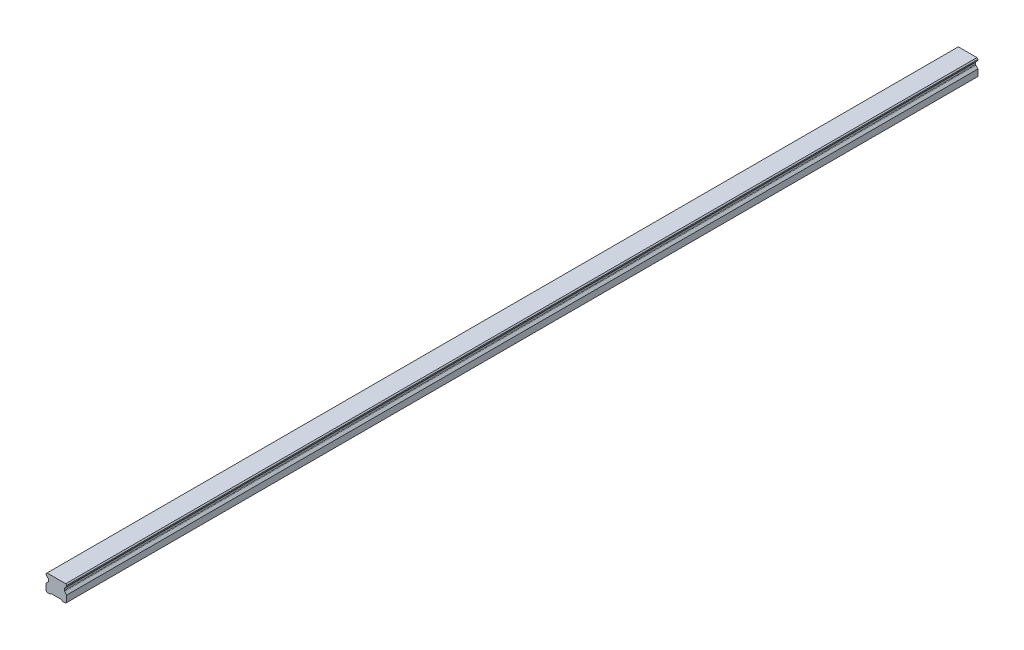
from build123d import *

# Parameters (mm, degrees)
SKETCH1_W           = 20
SKETCH1_H           = 16.3
BOSS_EXTRUDE1_DEPTH = 440
CUT_EXTRUDE1_DEPTH  = 881.207753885
CHAMFER1_SIZE       = 1
FILLET1_R           = 1
CUT_EXTRUDE2_DEPTH  = 881.207753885
SKETCH5_R           = 3
SKETCH5_R_2         = 2.5
CUT_EXTRUDE5_DEPTH  = 10
SKETCH5_2_R         = 2.5
CUT_EXTRUDE6_DEPTH  = 13
LPATTERN2_COUNT     = 15
LPATTERN2_PITCH     = 60


with BuildPart() as part:
    # Sketch1 → Boss-Extrude1 (new, symmetric)
    with BuildSketch(Plane.XY):
        with Locations((0, 8.15)):
            Rectangle(SKETCH1_W, SKETCH1_H)
    extrude(amount=BOSS_EXTRUDE1_DEPTH, both=True)

    # Sketch2 → Cut-Extrude1 (cut, through all)
    with BuildSketch(Plane.XY.offset(440)):
        Polygon((-10, 14.3), (-10, 7.3), (-7.666666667, 9.633333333), (-7.666666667, 11.966666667), align=None)
        Polygon((7.666666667, 11.966666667), (10, 14.3), (10, 7.3), (7.666666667, 9.633333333), align=None)
    extrude(amount=-CUT_EXTRUDE1_DEPTH, mode=Mode.SUBTRACT)

    # Chamfer1
    chamfer1_edges = [part.edges().sort_by_distance(p)[0] for p in [
        (-10, 16.3, 0),
        (10, 16.3, 0),
        (10, 0, 0),
        (-10, 0, 0),
    ]]
    chamfer(chamfer1_edges, length=CHAMFER1_SIZE)

    # Fillet1
    fillet1_edges = [part.edges().sort_by_distance(p)[0] for p in [
        (-7.666666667, 11.966666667, 0),
        (-7.666666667, 9.633333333, 0),
        (7.666666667, 9.633333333, 0),
        (7.666666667, 11.966666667, 0),
    ]]
    fillet(fillet1_edges, radius=FILLET1_R)

    # Sketch3 → Cut-Extrude2 (cut, through all)
    with BuildSketch(Plane.XY.offset(440)):
        Polygon((-6, 0), (-5, 1), (5, 1), (6, 0), align=None)
    extrude(amount=-CUT_EXTRUDE2_DEPTH, mode=Mode.SUBTRACT)

    # Sketch5 → Cut-Extrude5 (cut)
    with BuildSketch(Plane.XZ.offset(-1)):
        with Locations(Location((0, 420, 0), (0, 0, 270))):
            Circle(SKETCH5_R)
        with Locations(Location((0, 420, 0), (0, 0, 270))):
            Circle(SKETCH5_R_2, mode=Mode.SUBTRACT)
    cut_extrude5 = extrude(amount=-CUT_EXTRUDE5_DEPTH, mode=Mode.SUBTRACT)

    # Sketch5_2 → Cut-Extrude6 (cut)
    with BuildSketch(Plane.XZ.offset(-1)):
        with Locations(Location((0, 420, 0), (0, 0, 270))):
            Circle(SKETCH5_2_R)
    cut_extrude6 = extrude(amount=-CUT_EXTRUDE6_DEPTH, mode=Mode.SUBTRACT)

    # Cut-Extrude7 cone 1 section (on through the dimple's axis) → Cut-Extrude7 (revolve, cut)
    with BuildSketch(Plane(origin=(0, 14, 420), x_dir=(0, 0, -1), z_dir=(1, 0, 0))):
        Polygon((0, 0), (2.5, 0), (0, 1.443375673), align=None)
    cut_extrude7 = revolve(axis=Axis((0, 14, 420), (0, 1, 0)), mode=Mode.SUBTRACT)

    # LPattern2: Cut-Extrude5, Cut-Extrude6, Cut-Extrude7 ×15
    with Locations(*[(0, 0, -i * LPATTERN2_PITCH) for i in range(1, LPATTERN2_COUNT)]):
        add(cut_extrude5, mode=Mode.SUBTRACT)
        add(cut_extrude6, mode=Mode.SUBTRACT)
        add(cut_extrude7, mode=Mode.SUBTRACT)


solid = part.part
